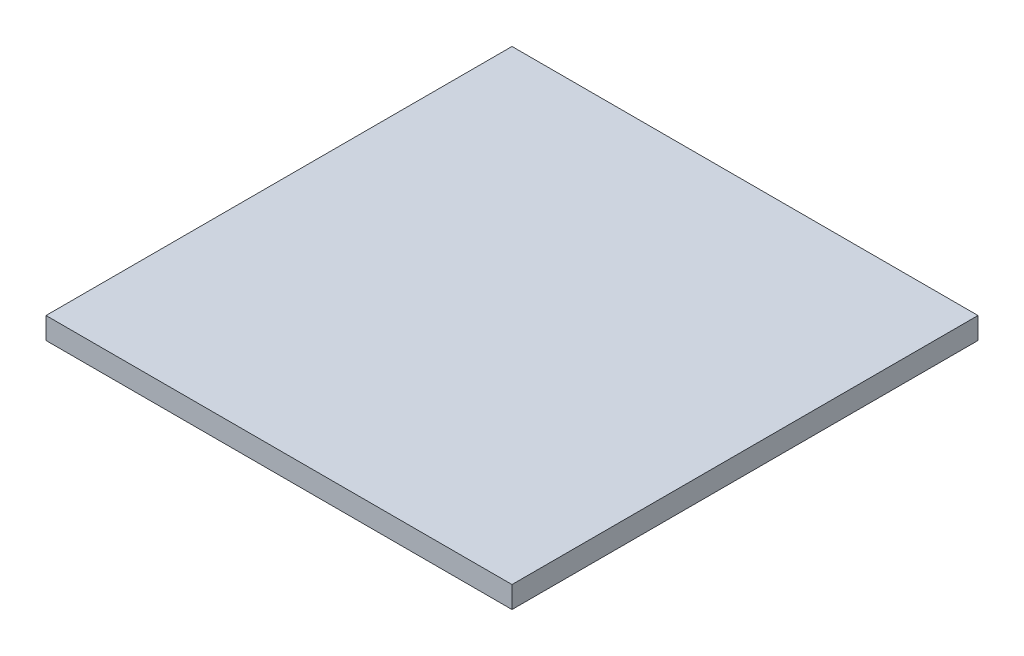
ISO-10303-21;
HEADER;
FILE_DESCRIPTION(('STEP AP214'),'2;1');
FILE_NAME('part.step','',(''),(''),'','','');
FILE_SCHEMA(('AUTOMOTIVE_DESIGN { 1 0 10303 214 1 1 1 1 }'));
ENDSEC;
DATA;
#1=APPLICATION_CONTEXT('core data for automotive mechanical design processes');
#2=APPLICATION_PROTOCOL_DEFINITION('international standard','automotive_design',2000,#1);
#3=PRODUCT_CONTEXT('',#1,'mechanical');
#4=PRODUCT('Part','Part','',(#3));
#5=PRODUCT_RELATED_PRODUCT_CATEGORY('part','',(#4));
#6=PRODUCT_DEFINITION_FORMATION('','',#4);
#7=PRODUCT_DEFINITION_CONTEXT('part definition',#1,'design');
#8=PRODUCT_DEFINITION('design','',#6,#7);
#9=PRODUCT_DEFINITION_SHAPE('','',#8);
#10=(LENGTH_UNIT() NAMED_UNIT(*) SI_UNIT(.MILLI.,.METRE.));
#11=(NAMED_UNIT(*) PLANE_ANGLE_UNIT() SI_UNIT($,.RADIAN.));
#12=(NAMED_UNIT(*) SI_UNIT($,.STERADIAN.) SOLID_ANGLE_UNIT());
#13=UNCERTAINTY_MEASURE_WITH_UNIT(LENGTH_MEASURE(1.E-05),#10,'distance_accuracy_value','');
#14=(GEOMETRIC_REPRESENTATION_CONTEXT(3) GLOBAL_UNCERTAINTY_ASSIGNED_CONTEXT((#13)) GLOBAL_UNIT_ASSIGNED_CONTEXT((#10,
#11,#12)) REPRESENTATION_CONTEXT('',''));
#15=CARTESIAN_POINT('',(0.,0.,0.));
#16=DIRECTION('',(0.,0.,1.));
#17=DIRECTION('',(1.,0.,0.));
#18=AXIS2_PLACEMENT_3D('',#15,#16,#17);
#19=CARTESIAN_POINT('',(21.5,2.,21.5));
#20=DIRECTION('',(-1.,0.,0.));
#21=DIRECTION('',(0.,0.,1.));
#22=AXIS2_PLACEMENT_3D('',#19,#20,#21);
#23=PLANE('',#22);
#24=DIRECTION('',(0.,0.,-1.));
#25=VECTOR('',#24,1.);
#26=CARTESIAN_POINT('',(21.5,0.,21.5));
#27=LINE('',#26,#25);
#28=CARTESIAN_POINT('',(21.5,0.,21.5));
#29=VERTEX_POINT('',#28);
#30=CARTESIAN_POINT('',(21.5,0.,-21.5));
#31=VERTEX_POINT('',#30);
#32=EDGE_CURVE('E102',#29,#31,#27,.T.);
#33=ORIENTED_EDGE('',*,*,#32,.T.);
#34=DIRECTION('',(0.,-1.,0.));
#35=VECTOR('',#34,1.);
#36=CARTESIAN_POINT('',(21.5,2.,-21.5));
#37=LINE('',#36,#35);
#38=CARTESIAN_POINT('',(21.5,2.,-21.5));
#39=VERTEX_POINT('',#38);
#40=EDGE_CURVE('E11',#39,#31,#37,.T.);
#41=ORIENTED_EDGE('',*,*,#40,.F.);
#42=DIRECTION('',(0.,0.,-1.));
#43=VECTOR('',#42,1.);
#44=CARTESIAN_POINT('',(21.5,2.,21.5));
#45=LINE('',#44,#43);
#46=CARTESIAN_POINT('',(21.5,2.,21.5));
#47=VERTEX_POINT('',#46);
#48=EDGE_CURVE('E90',#47,#39,#45,.T.);
#49=ORIENTED_EDGE('',*,*,#48,.F.);
#50=DIRECTION('',(0.,-1.,0.));
#51=VECTOR('',#50,1.);
#52=CARTESIAN_POINT('',(21.5,2.,21.5));
#53=LINE('',#52,#51);
#54=EDGE_CURVE('E98',#47,#29,#53,.T.);
#55=ORIENTED_EDGE('',*,*,#54,.T.);
#56=EDGE_LOOP('',(#33,#41,#49,#55));
#57=FACE_BOUND('',#56,.T.);
#58=ADVANCED_FACE('F39',(#57),#23,.F.);
#59=CARTESIAN_POINT('',(-21.5,2.,-21.5));
#60=DIRECTION('',(0.,0.,1.));
#61=DIRECTION('',(1.,0.,0.));
#62=AXIS2_PLACEMENT_3D('',#59,#60,#61);
#63=PLANE('',#62);
#64=DIRECTION('',(-1.,0.,0.));
#65=VECTOR('',#64,1.);
#66=CARTESIAN_POINT('',(-21.5,0.,-21.5));
#67=LINE('',#66,#65);
#68=CARTESIAN_POINT('',(-21.5,0.,-21.5));
#69=VERTEX_POINT('',#68);
#70=EDGE_CURVE('E94',#31,#69,#67,.T.);
#71=ORIENTED_EDGE('',*,*,#70,.T.);
#72=DIRECTION('',(0.,-1.,0.));
#73=VECTOR('',#72,1.);
#74=CARTESIAN_POINT('',(-21.5,2.,-21.5));
#75=LINE('',#74,#73);
#76=CARTESIAN_POINT('',(-21.5,2.,-21.5));
#77=VERTEX_POINT('',#76);
#78=EDGE_CURVE('E47',#77,#69,#75,.T.);
#79=ORIENTED_EDGE('',*,*,#78,.F.);
#80=DIRECTION('',(-1.,0.,0.));
#81=VECTOR('',#80,1.);
#82=CARTESIAN_POINT('',(-21.5,2.,-21.5));
#83=LINE('',#82,#81);
#84=EDGE_CURVE('E85',#39,#77,#83,.T.);
#85=ORIENTED_EDGE('',*,*,#84,.F.);
#86=ORIENTED_EDGE('',*,*,#40,.T.);
#87=EDGE_LOOP('',(#71,#79,#85,#86));
#88=FACE_BOUND('',#87,.T.);
#89=ADVANCED_FACE('F93',(#88),#63,.F.);
#90=CARTESIAN_POINT('',(-21.5,2.,21.5));
#91=DIRECTION('',(1.,0.,0.));
#92=DIRECTION('',(0.,0.,-1.));
#93=AXIS2_PLACEMENT_3D('',#90,#91,#92);
#94=PLANE('',#93);
#95=DIRECTION('',(0.,0.,1.));
#96=VECTOR('',#95,1.);
#97=CARTESIAN_POINT('',(-21.5,0.,21.5));
#98=LINE('',#97,#96);
#99=CARTESIAN_POINT('',(-21.5,0.,21.5));
#100=VERTEX_POINT('',#99);
#101=EDGE_CURVE('E72',#69,#100,#98,.T.);
#102=ORIENTED_EDGE('',*,*,#101,.T.);
#103=DIRECTION('',(0.,-1.,0.));
#104=VECTOR('',#103,1.);
#105=CARTESIAN_POINT('',(-21.5,2.,21.5));
#106=LINE('',#105,#104);
#107=CARTESIAN_POINT('',(-21.5,2.,21.5));
#108=VERTEX_POINT('',#107);
#109=EDGE_CURVE('E95',#108,#100,#106,.T.);
#110=ORIENTED_EDGE('',*,*,#109,.F.);
#111=DIRECTION('',(0.,0.,1.));
#112=VECTOR('',#111,1.);
#113=CARTESIAN_POINT('',(-21.5,2.,21.5));
#114=LINE('',#113,#112);
#115=EDGE_CURVE('E88',#77,#108,#114,.T.);
#116=ORIENTED_EDGE('',*,*,#115,.F.);
#117=ORIENTED_EDGE('',*,*,#78,.T.);
#118=EDGE_LOOP('',(#102,#110,#116,#117));
#119=FACE_BOUND('',#118,.T.);
#120=ADVANCED_FACE('F96',(#119),#94,.F.);
#121=CARTESIAN_POINT('',(-21.5,2.,21.5));
#122=DIRECTION('',(0.,0.,-1.));
#123=DIRECTION('',(-1.,0.,0.));
#124=AXIS2_PLACEMENT_3D('',#121,#122,#123);
#125=PLANE('',#124);
#126=DIRECTION('',(1.,0.,0.));
#127=VECTOR('',#126,1.);
#128=CARTESIAN_POINT('',(-21.5,0.,21.5));
#129=LINE('',#128,#127);
#130=EDGE_CURVE('E78',#100,#29,#129,.T.);
#131=ORIENTED_EDGE('',*,*,#130,.T.);
#132=ORIENTED_EDGE('',*,*,#54,.F.);
#133=DIRECTION('',(1.,0.,0.));
#134=VECTOR('',#133,1.);
#135=CARTESIAN_POINT('',(-21.5,2.,21.5));
#136=LINE('',#135,#134);
#137=EDGE_CURVE('E55',#108,#47,#136,.T.);
#138=ORIENTED_EDGE('',*,*,#137,.F.);
#139=ORIENTED_EDGE('',*,*,#109,.T.);
#140=EDGE_LOOP('',(#131,#132,#138,#139));
#141=FACE_BOUND('',#140,.T.);
#142=ADVANCED_FACE('F109',(#141),#125,.F.);
#143=CARTESIAN_POINT('',(0.,2.,0.));
#144=DIRECTION('',(0.,-1.,0.));
#145=DIRECTION('',(0.,0.,-1.));
#146=AXIS2_PLACEMENT_3D('',#143,#144,#145);
#147=PLANE('',#146);
#148=ORIENTED_EDGE('',*,*,#48,.T.);
#149=ORIENTED_EDGE('',*,*,#84,.T.);
#150=ORIENTED_EDGE('',*,*,#115,.T.);
#151=ORIENTED_EDGE('',*,*,#137,.T.);
#152=EDGE_LOOP('',(#148,#149,#150,#151));
#153=FACE_BOUND('',#152,.T.);
#154=ADVANCED_FACE('F86',(#153),#147,.F.);
#155=CARTESIAN_POINT('',(0.,0.,0.));
#156=DIRECTION('',(0.,-1.,0.));
#157=DIRECTION('',(0.,0.,-1.));
#158=AXIS2_PLACEMENT_3D('',#155,#156,#157);
#159=PLANE('',#158);
#160=ORIENTED_EDGE('',*,*,#32,.F.);
#161=ORIENTED_EDGE('',*,*,#130,.F.);
#162=ORIENTED_EDGE('',*,*,#101,.F.);
#163=ORIENTED_EDGE('',*,*,#70,.F.);
#164=EDGE_LOOP('',(#160,#161,#162,#163));
#165=FACE_BOUND('',#164,.T.);
#166=ADVANCED_FACE('F112',(#165),#159,.T.);
#167=CLOSED_SHELL('',(#58,#89,#120,#142,#154,#166));
#168=MANIFOLD_SOLID_BREP('B2',#167);
#169=ADVANCED_BREP_SHAPE_REPRESENTATION('',(#18,#168),#14);
#170=SHAPE_DEFINITION_REPRESENTATION(#9,#169);
ENDSEC;
END-ISO-10303-21;
